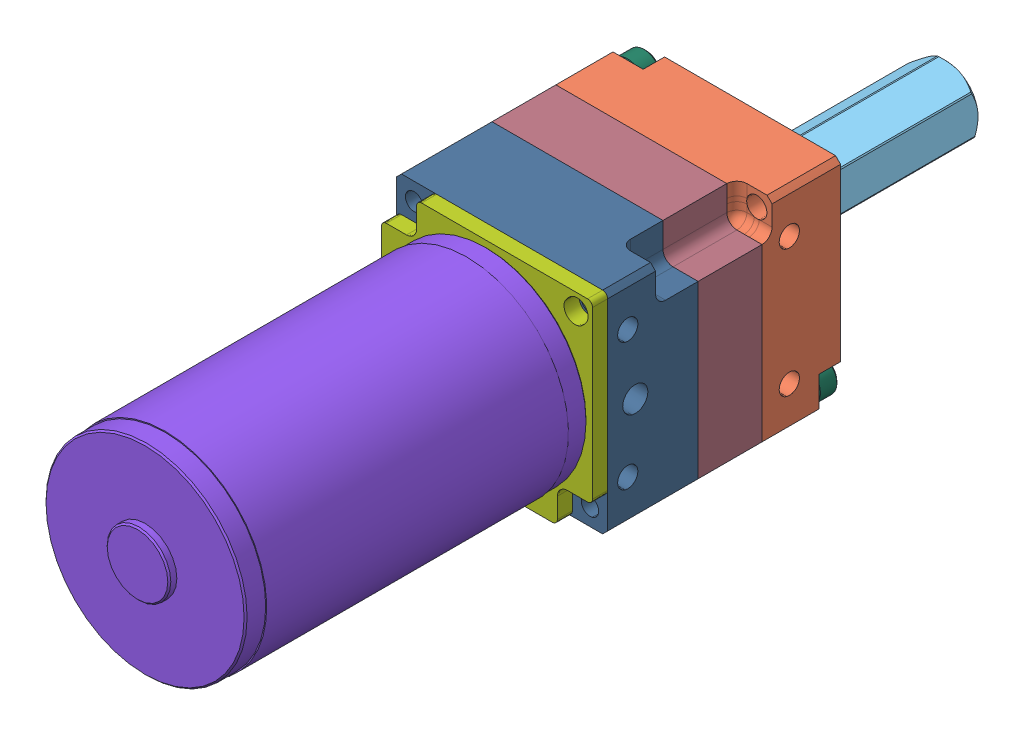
SolidWorks assembly VersaPlanetary-1-Stage-with-BAG-Motor.SLDASM, configuration Default (file format 7000). Lengths in mm.
Overall size (62.06 62.06 160.81).
22 component instances, 15 part files, 0 mates.
Components (placement in the parent):
- 217-2742-001 Rev4-1: 217-2742-001 Rev4.sldprt [Default] at (0 0 -19.9002) x (0 0 1) z (-1 0 0) size (7 28 28)
- 217-2742-001 Rev4-2: 217-2742-001 Rev4.sldprt [Default] at (0 0 -28.305) x (0 0 1) z (-0.819238 -0.573454 0) size (7 28 28)
- 217-2625-002 Rev1-1: 217-2625-002 Rev1.sldprt [Default] at (0 0 -6.2) x (-1 0 0) z (0 0 1) size (42 42 17.13)
- 217-2625-018 Rev1_98541A410-1: 217-2625-018 Rev1_98541A410.sldprt [Default] at (0 0 -12.4002) x (0 0 -1) z (0.980859 -0.194721 0) size (1 19.6 17.4)
- 217-2625-017 Rev1_9714K61-1: 217-2625-017 Rev1_9714K61.sldprt [Default] at (0 0 -20.9002) x (-0.695225 0.718792 0) z (-0.718792 -0.695225 0) size (28.51 4.98 30.18)
- Ouput Shafts^VersaPlanetary_500 Hex-1: Ouput Shafts^VersaPlanetary_500 Hex.sldasm [Default] at (0 0 -20.5526) x (-0.995515 -0.094608 0) z (0 0 -1) size (17 17 64.12)
  - 217-2625-003 Rev1-1: 217-2625-003 Rev1.sldprt [Default] at origin size (17 17 64.12)
- 217-3564-000 Rev1_BAG-1: 217-3564-000 Rev1_BAG.sldasm [Default] at (0 0 18) size (42 42 81.5)
  - 217-2625-011 Rev1-1: 217-2625-011 Rev1.sldprt [Default] at (0 0 -5.25) x (1 0 0) z (0 -1 0) size (8.01 7.5 7.94)
  - 217-2822-003 Rev4-1: 217-2822-003 Rev4.sldprt [Default] at (0 0 1.5) size (42 42 4.8)
  - 217-3351-1: 217-3351.sldprt [Default] at (0 0 3) x (0 1 0) z (0 0 -1) size (40.4 40.4 81.5)
- Input Housing^VersaPlanetary-1: Input Housing^VersaPlanetary.sldasm [Default] at (-18.5 13.6657 1) x (0 0 -1) z (-0.885621 0.464408 0) size (20 56.7 56.7)
  - PINL-M020-006-S-1: PINL-M020-006-S.sldprt [Default] at origin size (6 2 2)
  - 217-2625-001 Rev1-1: 217-2625-001 Rev1.sldprt [Default] at (-9.5 3.511 -22.7304) x (0 -0.464408 -0.885621) z (-1 0 0) size (42 42 18)
  - 217-2625-009 Rev1-1: 217-2625-009 Rev1.sldprt [Default] at (-6.02 3.511 -22.7304) x (0 0.885621 -0.464408) z (1 0 0) size (18 18 13)
  - SSS1032-0125ZB_94105A824-1: SSS1032-0125ZB_94105A824.sldprt [Default] at (-11.495 6.7192 -16.6126) x (-0.636804 0.682837 -0.35807) z (0 0.464408 0.885621) size (4.83 4.84 3.3)
- 217-2816 Rev1-1: 217-2816 Rev1.sldasm [Default] at (0 0 -6.35) x (1 0 0) z (0 0 -1) size (42 42 14.5)
  - 217-2816-001 Rev1-1: 217-2816-001 Rev1.sldprt [Default] at origin size (42 42 14.5)
- 217-2817 Rev1-1: 217-2817 Rev1.sldasm [Default] at (0 0 -10.8) x (-0.517538 0.85566 0) z (0 0 -1) size (21.94 21.95 12.7)
  - 217-2724-001 Rev1_Sun_Driver01-1: 217-2724-001 Rev1_Sun_Driver01.sldprt [Default] at (0 0 -6.375) x (0.984808 0.173648 0) z (0 0 1) size (18.94 18.95 12.7)
- SSA_SSA0832-1250ZC-1: SSA_SSA0832-1250ZC.sldprt [Default] at (-17.5 17.5 -24.061) x (0.699203 0.714923 0) z (-0.714923 0.699203 0) size (6.73 35.81 6.73)
- SSA_SSA0832-1250ZC-2: SSA_SSA0832-1250ZC.sldprt [Default] at (17.5 -17.5 -24.061) x (-0.999999 0.001665 0) z (-0.001665 -0.999999 0) size (6.73 35.81 6.73)
